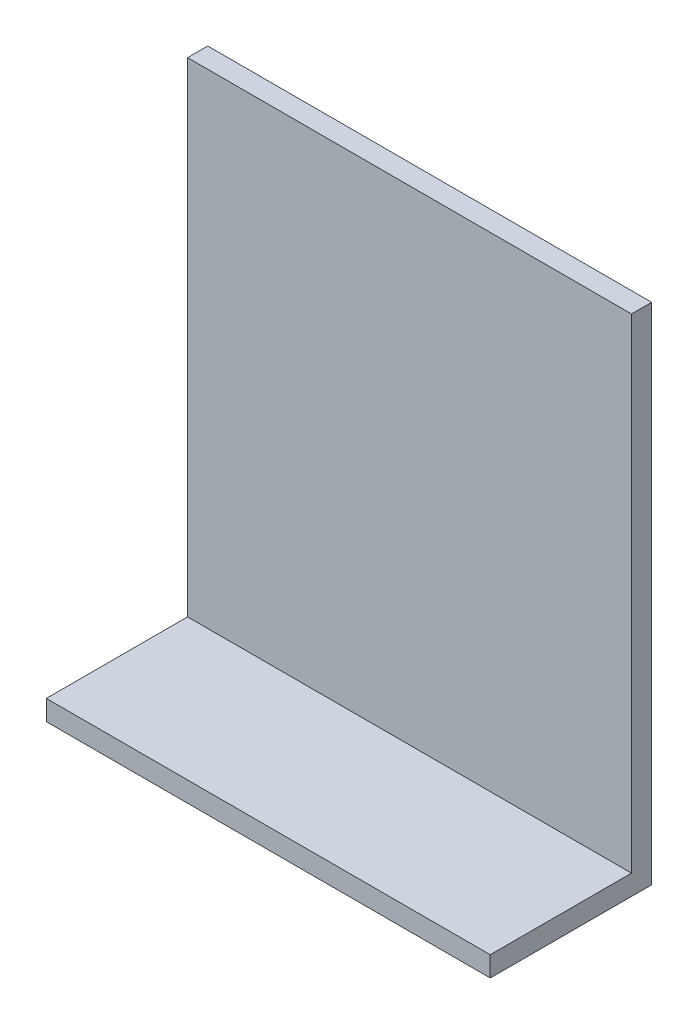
from build123d import *

# Parameters (mm, degrees)
EXTRUDE1_DEPTH      = 44
EXTRUDE1_DEPTH_BACK = 44


with BuildPart() as part:
    # Sketch1 → Extrude1 (new, two sides: drawn at the far end of the back side and taken through both)
    with BuildSketch(Plane(origin=(0, 0, 0), x_dir=(0, 0, -1), z_dir=(1, 0, 0)).offset(-EXTRUDE1_DEPTH_BACK)):
        Polygon((0, 0), (0, 100), (-4, 100), (-4, 4), (-32, 4), (-32, 0), align=None)
    extrude(amount=EXTRUDE1_DEPTH + EXTRUDE1_DEPTH_BACK)


solid = part.part
